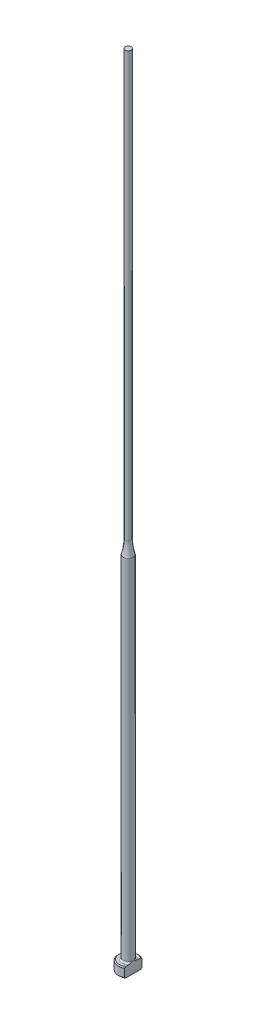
ISO-10303-21;
HEADER;
FILE_DESCRIPTION(('STEP AP214'),'2;1');
FILE_NAME('part.step','',(''),(''),'','','');
FILE_SCHEMA(('AUTOMOTIVE_DESIGN { 1 0 10303 214 1 1 1 1 }'));
ENDSEC;
DATA;
#1=APPLICATION_CONTEXT('core data for automotive mechanical design processes');
#2=APPLICATION_PROTOCOL_DEFINITION('international standard','automotive_design',2000,#1);
#3=PRODUCT_CONTEXT('',#1,'mechanical');
#4=PRODUCT('Part','Part','',(#3));
#5=PRODUCT_RELATED_PRODUCT_CATEGORY('part','',(#4));
#6=PRODUCT_DEFINITION_FORMATION('','',#4);
#7=PRODUCT_DEFINITION_CONTEXT('part definition',#1,'design');
#8=PRODUCT_DEFINITION('design','',#6,#7);
#9=PRODUCT_DEFINITION_SHAPE('','',#8);
#10=(LENGTH_UNIT() NAMED_UNIT(*) SI_UNIT(.MILLI.,.METRE.));
#11=(NAMED_UNIT(*) PLANE_ANGLE_UNIT() SI_UNIT($,.RADIAN.));
#12=(NAMED_UNIT(*) SI_UNIT($,.STERADIAN.) SOLID_ANGLE_UNIT());
#13=UNCERTAINTY_MEASURE_WITH_UNIT(LENGTH_MEASURE(1.E-05),#10,'distance_accuracy_value','');
#14=(GEOMETRIC_REPRESENTATION_CONTEXT(3) GLOBAL_UNCERTAINTY_ASSIGNED_CONTEXT((#13)) GLOBAL_UNIT_ASSIGNED_CONTEXT((#10,
#11,#12)) REPRESENTATION_CONTEXT('',''));
#15=CARTESIAN_POINT('',(0.,0.,0.));
#16=DIRECTION('',(0.,0.,1.));
#17=DIRECTION('',(1.,0.,0.));
#18=AXIS2_PLACEMENT_3D('',#15,#16,#17);
#19=CARTESIAN_POINT('',(-1.99999999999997,2.,0.));
#20=DIRECTION('',(0.,1.,0.));
#21=DIRECTION('',(0.,0.,1.));
#22=AXIS2_PLACEMENT_3D('',#19,#20,#21);
#23=PLANE('',#22);
#24=CARTESIAN_POINT('',(0.,2.,0.));
#25=DIRECTION('',(0.,1.,0.));
#26=DIRECTION('',(0.,0.,1.));
#27=AXIS2_PLACEMENT_3D('',#24,#25,#26);
#28=CIRCLE('',#27,1.79999999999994);
#29=CARTESIAN_POINT('',(0.999999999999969,2.,-1.49666295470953));
#30=VERTEX_POINT('',#29);
#31=CARTESIAN_POINT('',(0.999999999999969,2.,1.49666295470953));
#32=VERTEX_POINT('',#31);
#33=EDGE_CURVE('E187',#30,#32,#28,.T.);
#34=ORIENTED_EDGE('',*,*,#33,.T.);
#35=DIRECTION('',(0.,0.,-1.));
#36=VECTOR('',#35,1.);
#37=CARTESIAN_POINT('',(0.999999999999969,2.,0.));
#38=LINE('',#37,#36);
#39=CARTESIAN_POINT('',(0.999999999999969,2.00000000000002,0.830662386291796));
#40=VERTEX_POINT('',#39);
#41=EDGE_CURVE('E57',#32,#40,#38,.T.);
#42=ORIENTED_EDGE('',*,*,#41,.T.);
#43=CARTESIAN_POINT('',(0.,2.,0.));
#44=DIRECTION('',(0.,1.,0.));
#45=DIRECTION('',(0.,0.,1.));
#46=AXIS2_PLACEMENT_3D('',#43,#44,#45);
#47=CIRCLE('',#46,1.29999999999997);
#48=CARTESIAN_POINT('',(0.999999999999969,2.00000000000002,-0.830662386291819));
#49=VERTEX_POINT('',#48);
#50=EDGE_CURVE('E108',#40,#49,#47,.F.);
#51=ORIENTED_EDGE('',*,*,#50,.T.);
#52=EDGE_CURVE('E137',#49,#30,#38,.T.);
#53=ORIENTED_EDGE('',*,*,#52,.T.);
#54=EDGE_LOOP('',(#34,#42,#51,#53));
#55=FACE_BOUND('',#54,.T.);
#56=ADVANCED_FACE('F32',(#55),#23,.T.);
#57=CARTESIAN_POINT('',(0.,259.958771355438,0.));
#58=DIRECTION('',(0.,1.,0.));
#59=DIRECTION('',(0.,0.,1.));
#60=AXIS2_PLACEMENT_3D('',#57,#58,#59);
#61=CYLINDRICAL_SURFACE('',#60,1.99999999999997);
#62=CARTESIAN_POINT('',(0.,1.79999999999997,0.));
#63=DIRECTION('',(0.,1.,0.));
#64=DIRECTION('',(0.,0.,1.));
#65=AXIS2_PLACEMENT_3D('',#62,#63,#64);
#66=CIRCLE('',#65,1.99999999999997);
#67=CARTESIAN_POINT('',(0.999999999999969,1.79999999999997,1.73205080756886));
#68=VERTEX_POINT('',#67);
#69=CARTESIAN_POINT('',(0.999999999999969,1.79999999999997,-1.73205080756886));
#70=VERTEX_POINT('',#69);
#71=EDGE_CURVE('E105',#68,#70,#66,.F.);
#72=ORIENTED_EDGE('',*,*,#71,.T.);
#73=DIRECTION('',(0.,-1.,0.));
#74=VECTOR('',#73,1.);
#75=CARTESIAN_POINT('',(0.999999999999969,160.,-1.73205080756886));
#76=LINE('',#75,#74);
#77=CARTESIAN_POINT('',(0.999999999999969,0.199999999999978,-1.73205080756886));
#78=VERTEX_POINT('',#77);
#79=EDGE_CURVE('E193',#70,#78,#76,.T.);
#80=ORIENTED_EDGE('',*,*,#79,.T.);
#81=CARTESIAN_POINT('',(0.,0.199999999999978,0.));
#82=DIRECTION('',(0.,-1.,0.));
#83=DIRECTION('',(0.,0.,-1.));
#84=AXIS2_PLACEMENT_3D('',#81,#82,#83);
#85=CIRCLE('',#84,1.99999999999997);
#86=CARTESIAN_POINT('',(0.999999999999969,0.199999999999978,1.73205080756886));
#87=VERTEX_POINT('',#86);
#88=EDGE_CURVE('E100',#78,#87,#85,.F.);
#89=ORIENTED_EDGE('',*,*,#88,.T.);
#90=DIRECTION('',(0.,-1.,0.));
#91=VECTOR('',#90,1.);
#92=CARTESIAN_POINT('',(0.999999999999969,160.,1.73205080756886));
#93=LINE('',#92,#91);
#94=EDGE_CURVE('E93',#68,#87,#93,.T.);
#95=ORIENTED_EDGE('',*,*,#94,.F.);
#96=EDGE_LOOP('',(#72,#80,#89,#95));
#97=FACE_BOUND('',#96,.T.);
#98=ADVANCED_FACE('F158',(#97),#61,.T.);
#99=CARTESIAN_POINT('',(0.,0.,0.));
#100=DIRECTION('',(0.,-1.,0.));
#101=DIRECTION('',(0.,0.,-1.));
#102=AXIS2_PLACEMENT_3D('',#99,#100,#101);
#103=PLANE('',#102);
#104=CARTESIAN_POINT('',(0.,0.,0.));
#105=DIRECTION('',(0.,-1.,0.));
#106=DIRECTION('',(0.,0.,-1.));
#107=AXIS2_PLACEMENT_3D('',#104,#105,#106);
#108=CIRCLE('',#107,1.79999999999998);
#109=CARTESIAN_POINT('',(0.999999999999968,0.,1.49666295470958));
#110=VERTEX_POINT('',#109);
#111=CARTESIAN_POINT('',(0.999999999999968,0.,-1.49666295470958));
#112=VERTEX_POINT('',#111);
#113=EDGE_CURVE('E98',#110,#112,#108,.T.);
#114=ORIENTED_EDGE('',*,*,#113,.T.);
#115=DIRECTION('',(0.,0.,1.));
#116=VECTOR('',#115,1.);
#117=CARTESIAN_POINT('',(0.999999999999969,0.,-1.73205080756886));
#118=LINE('',#117,#116);
#119=EDGE_CURVE('E83',#112,#110,#118,.T.);
#120=ORIENTED_EDGE('',*,*,#119,.T.);
#121=EDGE_LOOP('',(#114,#120));
#122=FACE_BOUND('',#121,.T.);
#123=ADVANCED_FACE('F103',(#122),#103,.T.);
#124=CARTESIAN_POINT('',(0.,2.,0.));
#125=DIRECTION('',(0.,-1.,0.));
#126=DIRECTION('',(0.,0.,-1.));
#127=AXIS2_PLACEMENT_3D('',#124,#125,#126);
#128=CONICAL_SURFACE('',#127,1.79999999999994,0.785398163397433);
#129=ORIENTED_EDGE('',*,*,#71,.F.);
#130=CARTESIAN_POINT('',(0.999999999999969,-0.143084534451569,3.81417299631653));
#131=CARTESIAN_POINT('',(0.999999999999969,-0.0593997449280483,3.72765647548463));
#132=CARTESIAN_POINT('',(0.999999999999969,0.0241940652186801,3.64105173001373));
#133=CARTESIAN_POINT('',(0.999999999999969,0.191148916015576,3.46761616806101));
#134=CARTESIAN_POINT('',(0.999999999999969,0.274509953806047,3.3807853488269));
#135=CARTESIAN_POINT('',(0.999999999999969,0.524249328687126,3.11979400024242));
#136=CARTESIAN_POINT('',(0.999999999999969,0.690198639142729,2.94522254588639));
#137=CARTESIAN_POINT('',(0.999999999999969,1.01697550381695,2.59782670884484));
#138=CARTESIAN_POINT('',(0.999999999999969,1.17783928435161,2.42503661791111));
#139=CARTESIAN_POINT('',(0.999999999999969,1.41669118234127,2.16364984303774));
#140=CARTESIAN_POINT('',(0.999999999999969,1.49589273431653,2.07616357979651));
#141=CARTESIAN_POINT('',(0.999999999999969,1.65313803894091,1.90015721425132));
#142=CARTESIAN_POINT('',(0.999999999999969,1.73118183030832,1.81163714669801));
#143=CARTESIAN_POINT('',(0.999999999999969,1.85567318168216,1.66767927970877));
#144=CARTESIAN_POINT('',(0.999999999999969,1.90265415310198,1.61270332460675));
#145=CARTESIAN_POINT('',(0.999999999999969,1.99577882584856,1.50203557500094));
#146=CARTESIAN_POINT('',(0.999999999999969,2.04192244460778,1.44634371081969));
#147=CARTESIAN_POINT('',(0.999999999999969,2.13356596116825,1.33345480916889));
#148=CARTESIAN_POINT('',(0.999999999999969,2.17905399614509,1.2762481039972));
#149=CARTESIAN_POINT('',(0.999999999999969,2.26844283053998,1.16060976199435));
#150=CARTESIAN_POINT('',(0.999999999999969,2.3123437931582,1.10217825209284));
#151=CARTESIAN_POINT('',(0.999999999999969,2.39853453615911,0.982773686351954));
#152=CARTESIAN_POINT('',(0.999999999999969,2.44078986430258,0.921775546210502));
#153=CARTESIAN_POINT('',(0.999999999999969,2.52187810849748,0.797387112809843));
#154=CARTESIAN_POINT('',(0.999999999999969,2.56070631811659,0.733993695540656));
#155=CARTESIAN_POINT('',(0.999999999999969,2.6324859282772,0.604932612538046));
#156=CARTESIAN_POINT('',(0.999999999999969,2.66550424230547,0.539302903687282));
#157=CARTESIAN_POINT('',(0.999999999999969,2.72301550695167,0.404437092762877));
#158=CARTESIAN_POINT('',(0.999999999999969,2.74753707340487,0.335214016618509));
#159=CARTESIAN_POINT('',(0.999999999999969,2.77407110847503,0.231400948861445));
#160=CARTESIAN_POINT('',(0.999999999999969,2.78110742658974,0.198093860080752));
#161=CARTESIAN_POINT('',(0.999999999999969,2.79200506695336,0.130954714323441));
#162=CARTESIAN_POINT('',(0.999999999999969,2.7958666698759,0.0971227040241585));
#163=CARTESIAN_POINT('',(0.999999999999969,2.80013905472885,0.0293410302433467));
#164=CARTESIAN_POINT('',(0.999999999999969,2.80056046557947,-0.00460794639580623));
#165=CARTESIAN_POINT('',(0.999999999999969,2.79795882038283,-0.0723663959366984));
#166=CARTESIAN_POINT('',(0.999999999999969,2.79493547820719,-0.106175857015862));
#167=CARTESIAN_POINT('',(0.999999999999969,2.78105481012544,-0.206326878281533));
#168=CARTESIAN_POINT('',(0.999999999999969,2.76542146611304,-0.272037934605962));
#169=CARTESIAN_POINT('',(0.999999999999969,2.73477554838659,-0.368312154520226));
#170=CARTESIAN_POINT('',(0.999999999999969,2.72331063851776,-0.40012349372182));
#171=CARTESIAN_POINT('',(0.999999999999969,2.69840546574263,-0.46296441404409));
#172=CARTESIAN_POINT('',(0.999999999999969,2.68496560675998,-0.493994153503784));
#173=CARTESIAN_POINT('',(0.999999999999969,2.64209309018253,-0.586298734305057));
#174=CARTESIAN_POINT('',(0.999999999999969,2.61022871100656,-0.64643570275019));
#175=CARTESIAN_POINT('',(0.999999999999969,2.5422853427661,-0.764304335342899));
#176=CARTESIAN_POINT('',(0.999999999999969,2.50620119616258,-0.822032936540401));
#177=CARTESIAN_POINT('',(0.999999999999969,2.43107084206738,-0.935840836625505));
#178=CARTESIAN_POINT('',(0.999999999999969,2.39201347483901,-0.991912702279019));
#179=CARTESIAN_POINT('',(0.999999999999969,2.31195870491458,-1.10259849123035));
#180=CARTESIAN_POINT('',(0.999999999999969,2.27096226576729,-1.15721311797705));
#181=CARTESIAN_POINT('',(0.999999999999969,2.18701695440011,-1.26606869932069));
#182=CARTESIAN_POINT('',(0.999999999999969,2.14404946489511,-1.32029522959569));
#183=CARTESIAN_POINT('',(0.999999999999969,2.0570505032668,-1.4278898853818));
#184=CARTESIAN_POINT('',(0.999999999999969,2.01301896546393,-1.48125795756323));
#185=CARTESIAN_POINT('',(0.999999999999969,1.87995068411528,-1.64010952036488));
#186=CARTESIAN_POINT('',(0.999999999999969,1.78973357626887,-1.74460261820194));
#187=CARTESIAN_POINT('',(0.999999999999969,1.62290341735,-1.93426834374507));
#188=CARTESIAN_POINT('',(0.999999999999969,1.54658658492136,-2.01970404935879));
#189=CARTESIAN_POINT('',(0.999999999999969,1.39301250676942,-2.18973019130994));
#190=CARTESIAN_POINT('',(0.999999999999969,1.31575523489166,-2.27432060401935));
#191=CARTESIAN_POINT('',(0.999999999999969,1.08283440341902,-2.52732479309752));
#192=CARTESIAN_POINT('',(0.999999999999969,0.926165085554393,-2.69481086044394));
#193=CARTESIAN_POINT('',(0.999999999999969,0.617772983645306,-3.02147252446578));
#194=CARTESIAN_POINT('',(0.999999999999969,0.466111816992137,-3.18070657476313));
#195=CARTESIAN_POINT('',(0.999999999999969,0.238015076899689,-3.41880818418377));
#196=CARTESIAN_POINT('',(0.999999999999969,0.1619245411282,-3.49800657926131));
#197=CARTESIAN_POINT('',(0.999999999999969,0.00955322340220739,-3.65621892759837));
#198=CARTESIAN_POINT('',(0.999999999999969,-0.0667275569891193,-3.73523288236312));
#199=CARTESIAN_POINT('',(0.999999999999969,-0.14308453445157,-3.81417299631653));
#200=B_SPLINE_CURVE_WITH_KNOTS('',3,(#130,#131,#132,#133,#134,#135,#136,#137,#138,#139,#140,
#141,#142,#143,#144,#145,#146,#147,#148,#149,#150,#151,#152,#153,#154,#155,#156,#157,#158,#159,
#160,#161,#162,#163,#164,#165,#166,#167,#168,#169,#170,#171,#172,#173,#174,#175,#176,#177,#178,
#179,#180,#181,#182,#183,#184,#185,#186,#187,#188,#189,#190,#191,#192,#193,#194,#195,#196,#197,
#198,#199),.UNSPECIFIED.,.F.,.F.,(4,2,2,2,2,2,2,2,2,2,2,2,2,2,2,2,2,2,2,2,2,2,2,2,2,2,2,2,2,2,2,
2,2,2,4),(0.,0.36110162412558,0.722207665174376,1.44478731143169,2.15299784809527,
2.5070263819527,2.8610430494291,3.07798416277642,3.29494655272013,3.51418925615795,
3.73340935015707,3.95594813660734,4.17878792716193,4.39886399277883,4.61819150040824,
4.72018864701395,4.82217677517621,4.92384967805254,5.02553102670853,5.22698459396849,
5.32838854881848,5.4297717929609,5.63365200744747,5.837784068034,6.04272417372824,
6.24756349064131,6.45510395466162,6.66265726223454,7.07676259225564,7.42043039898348,
7.76410778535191,8.45210822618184,9.11180822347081,9.44129145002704,9.77077197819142),.UNSPECIFIED.);
#201=EDGE_CURVE('E136',#68,#32,#200,.T.);
#202=ORIENTED_EDGE('',*,*,#201,.T.);
#203=ORIENTED_EDGE('',*,*,#33,.F.);
#204=EDGE_CURVE('E128',#30,#70,#200,.T.);
#205=ORIENTED_EDGE('',*,*,#204,.T.);
#206=EDGE_LOOP('',(#129,#202,#203,#205));
#207=FACE_BOUND('',#206,.T.);
#208=ADVANCED_FACE('F144',(#207),#128,.T.);
#209=CARTESIAN_POINT('',(0.,0.199999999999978,0.));
#210=DIRECTION('',(0.,1.,0.));
#211=DIRECTION('',(0.,0.,1.));
#212=AXIS2_PLACEMENT_3D('',#209,#210,#211);
#213=CONICAL_SURFACE('',#212,1.99999999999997,0.785398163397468);
#214=ORIENTED_EDGE('',*,*,#88,.F.);
#215=CARTESIAN_POINT('',(0.999999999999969,2.14308453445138,-3.81417299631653));
#216=CARTESIAN_POINT('',(0.999999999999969,2.05939974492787,-3.72765647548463));
#217=CARTESIAN_POINT('',(0.999999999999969,1.97580593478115,-3.64105173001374));
#218=CARTESIAN_POINT('',(0.999999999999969,1.80885108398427,-3.46761616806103));
#219=CARTESIAN_POINT('',(0.999999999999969,1.72549004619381,-3.38078534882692));
#220=CARTESIAN_POINT('',(0.999999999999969,1.47575067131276,-3.11979400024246));
#221=CARTESIAN_POINT('',(0.999999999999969,1.30980136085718,-2.94522254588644));
#222=CARTESIAN_POINT('',(0.999999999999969,0.983024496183,-2.5978267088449));
#223=CARTESIAN_POINT('',(0.999999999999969,0.822160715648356,-2.42503661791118));
#224=CARTESIAN_POINT('',(0.999999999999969,0.583308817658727,-2.16364984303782));
#225=CARTESIAN_POINT('',(0.999999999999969,0.50410726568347,-2.0761635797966));
#226=CARTESIAN_POINT('',(0.999999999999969,0.346861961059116,-1.90015721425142));
#227=CARTESIAN_POINT('',(0.999999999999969,0.26881816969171,-1.81163714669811));
#228=CARTESIAN_POINT('',(0.999999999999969,0.144326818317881,-1.66767927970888));
#229=CARTESIAN_POINT('',(0.999999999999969,0.0973458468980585,-1.61270332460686));
#230=CARTESIAN_POINT('',(0.999999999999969,0.00422117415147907,-1.50203557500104));
#231=CARTESIAN_POINT('',(0.999999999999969,-0.0419224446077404,-1.44634371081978));
#232=CARTESIAN_POINT('',(0.999999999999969,-0.133565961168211,-1.33345480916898));
#233=CARTESIAN_POINT('',(0.999999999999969,-0.179053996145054,-1.27624810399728));
#234=CARTESIAN_POINT('',(0.999999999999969,-0.268442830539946,-1.16060976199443));
#235=CARTESIAN_POINT('',(0.999999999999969,-0.31234379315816,-1.10217825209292));
#236=CARTESIAN_POINT('',(0.999999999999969,-0.398534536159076,-0.982773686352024));
#237=CARTESIAN_POINT('',(0.999999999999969,-0.440789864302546,-0.92177554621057));
#238=CARTESIAN_POINT('',(0.999999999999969,-0.521878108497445,-0.797387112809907));
#239=CARTESIAN_POINT('',(0.999999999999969,-0.560706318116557,-0.733993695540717));
#240=CARTESIAN_POINT('',(0.999999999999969,-0.632485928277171,-0.604932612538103));
#241=CARTESIAN_POINT('',(0.999999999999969,-0.665504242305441,-0.539302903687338));
#242=CARTESIAN_POINT('',(0.999999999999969,-0.723015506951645,-0.404437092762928));
#243=CARTESIAN_POINT('',(0.999999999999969,-0.747537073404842,-0.335214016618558));
#244=CARTESIAN_POINT('',(0.999999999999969,-0.774071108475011,-0.231400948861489));
#245=CARTESIAN_POINT('',(0.999999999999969,-0.781107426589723,-0.198093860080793));
#246=CARTESIAN_POINT('',(0.999999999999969,-0.792005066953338,-0.130954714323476));
#247=CARTESIAN_POINT('',(0.999999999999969,-0.795866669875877,-0.0971227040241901));
#248=CARTESIAN_POINT('',(0.999999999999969,-0.800139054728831,-0.0293410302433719));
#249=CARTESIAN_POINT('',(0.999999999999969,-0.80056046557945,0.00460794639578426));
#250=CARTESIAN_POINT('',(0.999999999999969,-0.797958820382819,0.0723663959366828));
#251=CARTESIAN_POINT('',(0.999999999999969,-0.794935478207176,0.106175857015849));
#252=CARTESIAN_POINT('',(0.999999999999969,-0.781054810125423,0.20632687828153));
#253=CARTESIAN_POINT('',(0.999999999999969,-0.765421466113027,0.272037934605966));
#254=CARTESIAN_POINT('',(0.999999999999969,-0.734775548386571,0.36831215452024));
#255=CARTESIAN_POINT('',(0.999999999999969,-0.723310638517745,0.400123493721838));
#256=CARTESIAN_POINT('',(0.999999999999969,-0.698405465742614,0.462964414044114));
#257=CARTESIAN_POINT('',(0.999999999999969,-0.684965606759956,0.493994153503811));
#258=CARTESIAN_POINT('',(0.999999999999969,-0.642093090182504,0.586298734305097));
#259=CARTESIAN_POINT('',(0.999999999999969,-0.610228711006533,0.646435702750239));
#260=CARTESIAN_POINT('',(0.999999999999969,-0.542285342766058,0.764304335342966));
#261=CARTESIAN_POINT('',(0.999999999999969,-0.506201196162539,0.822032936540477));
#262=CARTESIAN_POINT('',(0.999999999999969,-0.431070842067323,0.935840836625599));
#263=CARTESIAN_POINT('',(0.999999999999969,-0.392013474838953,0.991912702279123));
#264=CARTESIAN_POINT('',(0.999999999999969,-0.311958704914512,1.10259849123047));
#265=CARTESIAN_POINT('',(0.999999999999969,-0.270962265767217,1.15721311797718));
#266=CARTESIAN_POINT('',(0.999999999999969,-0.187016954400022,1.26606869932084));
#267=CARTESIAN_POINT('',(0.999999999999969,-0.144049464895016,1.32029522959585));
#268=CARTESIAN_POINT('',(0.999999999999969,-0.0570505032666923,1.42788988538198));
#269=CARTESIAN_POINT('',(0.999999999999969,-0.0130189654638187,1.48125795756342));
#270=CARTESIAN_POINT('',(0.999999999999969,0.120049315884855,1.64010952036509));
#271=CARTESIAN_POINT('',(0.999999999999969,0.21026642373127,1.74460261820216));
#272=CARTESIAN_POINT('',(0.999999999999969,0.37709658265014,1.9342683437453));
#273=CARTESIAN_POINT('',(0.999999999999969,0.453413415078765,2.01970404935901));
#274=CARTESIAN_POINT('',(0.999999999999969,0.606987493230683,2.18973019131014));
#275=CARTESIAN_POINT('',(0.999999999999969,0.684244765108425,2.27432060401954));
#276=CARTESIAN_POINT('',(0.999999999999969,0.917165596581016,2.52732479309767));
#277=CARTESIAN_POINT('',(0.999999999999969,1.07383491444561,2.69481086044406));
#278=CARTESIAN_POINT('',(0.999999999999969,1.38222701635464,3.02147252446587));
#279=CARTESIAN_POINT('',(0.999999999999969,1.53388818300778,3.1807065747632));
#280=CARTESIAN_POINT('',(0.999999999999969,1.76198492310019,3.41880818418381));
#281=CARTESIAN_POINT('',(0.999999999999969,1.83807545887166,3.49800657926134));
#282=CARTESIAN_POINT('',(0.999999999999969,1.99044677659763,3.65621892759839));
#283=CARTESIAN_POINT('',(0.999999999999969,2.06672755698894,3.73523288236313));
#284=CARTESIAN_POINT('',(0.999999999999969,2.14308453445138,3.81417299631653));
#285=B_SPLINE_CURVE_WITH_KNOTS('',3,(#215,#216,#217,#218,#219,#220,#221,#222,#223,#224,#225,
#226,#227,#228,#229,#230,#231,#232,#233,#234,#235,#236,#237,#238,#239,#240,#241,#242,#243,#244,
#245,#246,#247,#248,#249,#250,#251,#252,#253,#254,#255,#256,#257,#258,#259,#260,#261,#262,#263,
#264,#265,#266,#267,#268,#269,#270,#271,#272,#273,#274,#275,#276,#277,#278,#279,#280,#281,#282,
#283,#284),.UNSPECIFIED.,.F.,.F.,(4,2,2,2,2,2,2,2,2,2,2,2,2,2,2,2,2,2,2,2,2,2,2,2,2,2,2,2,2,2,2,
2,2,2,4),(0.,0.36110162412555,0.722207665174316,1.44478731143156,2.15299784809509,
2.5070263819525,2.86104304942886,3.07798416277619,3.2949465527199,3.51418925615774,
3.73340935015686,3.95594813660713,4.17878792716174,4.39886399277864,4.61819150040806,
4.72018864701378,4.82217677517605,4.92384967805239,5.02553102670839,5.22698459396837,
5.32838854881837,5.4297717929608,5.6336520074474,5.83778406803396,6.04272417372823,
6.24756349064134,6.45510395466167,6.66265726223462,7.07676259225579,7.42043039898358,
7.76410778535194,8.45210822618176,9.11180822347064,9.44129145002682,9.77077197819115),.UNSPECIFIED.);
#286=EDGE_CURVE('E86',#78,#112,#285,.T.);
#287=ORIENTED_EDGE('',*,*,#286,.T.);
#288=ORIENTED_EDGE('',*,*,#113,.F.);
#289=EDGE_CURVE('E89',#110,#87,#285,.T.);
#290=ORIENTED_EDGE('',*,*,#289,.T.);
#291=EDGE_LOOP('',(#214,#287,#288,#290));
#292=FACE_BOUND('',#291,.T.);
#293=ADVANCED_FACE('F97',(#292),#213,.T.);
#294=CARTESIAN_POINT('',(0.,2.30000000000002,0.));
#295=DIRECTION('',(0.,1.,0.));
#296=DIRECTION('',(0.,0.,1.));
#297=AXIS2_PLACEMENT_3D('',#294,#295,#296);
#298=TOROIDAL_SURFACE('',#297,1.29999999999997,0.3);
#299=CARTESIAN_POINT('',(0.999999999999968,2.30000000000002,0.));
#300=CARTESIAN_POINT('',(0.999999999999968,2.30000064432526,8.6574445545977E-12));
#301=CARTESIAN_POINT('',(0.999999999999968,2.30000128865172,-9.05742231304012E-08));
#302=CARTESIAN_POINT('',(0.999999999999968,2.30000254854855,-3.98319620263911E-07));
#303=CARTESIAN_POINT('',(0.999999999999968,2.30000316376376,-6.16748313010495E-07));
#304=CARTESIAN_POINT('',(0.999999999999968,2.30000438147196,-1.15047367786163E-06));
#305=CARTESIAN_POINT('',(0.999999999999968,2.30000498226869,-1.46954564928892E-06));
#306=CARTESIAN_POINT('',(0.999999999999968,2.30000613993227,-2.17388585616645E-06));
#307=CARTESIAN_POINT('',(0.999999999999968,2.3000066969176,-2.55896592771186E-06));
#308=CARTESIAN_POINT('',(0.999999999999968,2.30000847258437,-3.89137454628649E-06));
#309=CARTESIAN_POINT('',(0.999999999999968,2.30000962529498,-4.9272569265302E-06));
#310=CARTESIAN_POINT('',(0.999999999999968,2.30001175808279,-7.12255376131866E-06));
#311=CARTESIAN_POINT('',(0.999999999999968,2.30001274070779,-8.27963246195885E-06));
#312=CARTESIAN_POINT('',(0.999999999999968,2.30001619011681,-1.25710396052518E-05));
#313=CARTESIAN_POINT('',(0.999999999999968,2.30001847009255,-1.58589994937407E-05));
#314=CARTESIAN_POINT('',(0.999999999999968,2.3000224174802,-2.25210462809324E-05));
#315=CARTESIAN_POINT('',(0.999999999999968,2.30002411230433,-2.58796667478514E-05));
#316=CARTESIAN_POINT('',(0.999999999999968,2.30003085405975,-3.94941957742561E-05));
#317=CARTESIAN_POINT('',(0.999999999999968,2.30003568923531,-4.98493079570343E-05));
#318=CARTESIAN_POINT('',(0.999999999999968,2.30004388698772,-6.96407730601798E-05));
#319=CARTESIAN_POINT('',(0.999999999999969,2.30004735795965,-7.903098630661E-05));
#320=CARTESIAN_POINT('',(0.999999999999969,2.30007348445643,-0.000144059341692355));
#321=CARTESIAN_POINT('',(0.999999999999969,2.30010510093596,-0.000195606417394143));
#322=CARTESIAN_POINT('',(0.999999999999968,2.30022061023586,-0.000391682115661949));
#323=CARTESIAN_POINT('',(0.999999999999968,2.3002978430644,-0.000539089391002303));
#324=CARTESIAN_POINT('',(0.999999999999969,2.30059433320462,-0.00109591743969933));
#325=CARTESIAN_POINT('',(0.999999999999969,2.30082052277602,-0.00150237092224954));
#326=CARTESIAN_POINT('',(0.999999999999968,2.30171558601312,-0.00311941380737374));
#327=CARTESIAN_POINT('',(0.999999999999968,2.30237677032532,-0.00433326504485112));
#328=CARTESIAN_POINT('',(0.999999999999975,2.31602135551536,-0.0293725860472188));
#329=CARTESIAN_POINT('',(0.99999999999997,2.32909104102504,-0.0531623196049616));
#330=CARTESIAN_POINT('',(0.999999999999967,2.35458080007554,-0.100088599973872));
#331=CARTESIAN_POINT('',(0.999999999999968,2.36700820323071,-0.123221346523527));
#332=CARTESIAN_POINT('',(0.999999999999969,2.39281545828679,-0.172044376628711));
#333=CARTESIAN_POINT('',(0.999999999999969,2.4061616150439,-0.197752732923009));
#334=CARTESIAN_POINT('',(0.999999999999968,2.4323541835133,-0.249714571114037));
#335=CARTESIAN_POINT('',(0.999999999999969,2.44519503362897,-0.27597087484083));
#336=CARTESIAN_POINT('',(0.999999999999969,2.46718175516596,-0.322864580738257));
#337=CARTESIAN_POINT('',(0.999999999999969,2.47650292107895,-0.34341923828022));
#338=CARTESIAN_POINT('',(0.999999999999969,2.49448113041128,-0.384761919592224));
#339=CARTESIAN_POINT('',(0.999999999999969,2.50313958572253,-0.405549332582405));
#340=CARTESIAN_POINT('',(0.999999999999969,2.5276434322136,-0.467585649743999));
#341=CARTESIAN_POINT('',(0.999999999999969,2.54239224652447,-0.509286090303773));
#342=CARTESIAN_POINT('',(0.999999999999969,2.56458900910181,-0.58349816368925));
#343=CARTESIAN_POINT('',(0.999999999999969,2.57294045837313,-0.61573699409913));
#344=CARTESIAN_POINT('',(0.999999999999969,2.58691787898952,-0.682155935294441));
#345=CARTESIAN_POINT('',(0.999999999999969,2.5924232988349,-0.716362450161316));
#346=CARTESIAN_POINT('',(0.999999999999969,2.59932200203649,-0.784996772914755));
#347=CARTESIAN_POINT('',(0.999999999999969,2.60074119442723,-0.819421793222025));
#348=CARTESIAN_POINT('',(0.999999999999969,2.59853032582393,-0.88779225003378));
#349=CARTESIAN_POINT('',(0.999999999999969,2.59495737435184,-0.921738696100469));
#350=CARTESIAN_POINT('',(0.999999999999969,2.58381038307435,-0.977927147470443));
#351=CARTESIAN_POINT('',(0.999999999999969,2.57785171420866,-1.00048693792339));
#352=CARTESIAN_POINT('',(0.999999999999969,2.56267132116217,-1.0445512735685));
#353=CARTESIAN_POINT('',(0.999999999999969,2.55344592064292,-1.06605459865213));
#354=CARTESIAN_POINT('',(0.999999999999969,2.53348156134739,-1.10327564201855));
#355=CARTESIAN_POINT('',(0.999999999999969,2.52335553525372,-1.11931996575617));
#356=CARTESIAN_POINT('',(0.999999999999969,2.50063930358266,-1.1495565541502));
#357=CARTESIAN_POINT('',(0.999999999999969,2.48805327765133,-1.16375189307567));
#358=CARTESIAN_POINT('',(0.999999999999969,2.46313284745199,-1.18709127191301));
#359=CARTESIAN_POINT('',(0.999999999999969,2.45121755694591,-1.19668155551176));
#360=CARTESIAN_POINT('',(0.999999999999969,2.4259612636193,-1.21377371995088));
#361=CARTESIAN_POINT('',(0.999999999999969,2.41262072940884,-1.2212762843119));
#362=CARTESIAN_POINT('',(0.999999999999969,2.38471163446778,-1.23381879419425));
#363=CARTESIAN_POINT('',(0.999999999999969,2.3701356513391,-1.23884240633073));
#364=CARTESIAN_POINT('',(0.999999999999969,2.34029120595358,-1.2460136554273));
#365=CARTESIAN_POINT('',(0.999999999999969,2.32502317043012,-1.24816304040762));
#366=CARTESIAN_POINT('',(0.999999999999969,2.29609418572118,-1.24936303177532));
#367=CARTESIAN_POINT('',(0.999999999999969,2.28244572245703,-1.24873511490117));
#368=CARTESIAN_POINT('',(0.999999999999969,2.25546467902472,-1.24513625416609));
#369=CARTESIAN_POINT('',(0.999999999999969,2.2421320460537,-1.24216570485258));
#370=CARTESIAN_POINT('',(0.999999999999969,2.21644742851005,-1.23414136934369));
#371=CARTESIAN_POINT('',(0.999999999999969,2.20408009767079,-1.22913614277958));
#372=CARTESIAN_POINT('',(0.999999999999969,2.18026539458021,-1.2172891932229));
#373=CARTESIAN_POINT('',(0.999999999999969,2.16881815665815,-1.21044720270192));
#374=CARTESIAN_POINT('',(0.999999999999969,2.14602713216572,-1.19450929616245));
#375=CARTESIAN_POINT('',(0.999999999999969,2.1347876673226,-1.18526487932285));
#376=CARTESIAN_POINT('',(0.999999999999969,2.11372805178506,-1.16528066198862));
#377=CARTESIAN_POINT('',(0.999999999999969,2.1039092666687,-1.15453944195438));
#378=CARTESIAN_POINT('',(0.999999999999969,2.08131380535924,-1.12639326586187));
#379=CARTESIAN_POINT('',(0.999999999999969,2.06941227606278,-1.10828305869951));
#380=CARTESIAN_POINT('',(0.999999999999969,2.04871157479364,-1.07041295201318));
#381=CARTESIAN_POINT('',(0.999999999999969,2.03991325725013,-1.05065259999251));
#382=CARTESIAN_POINT('',(0.999999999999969,2.02219264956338,-1.00203188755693));
#383=CARTESIAN_POINT('',(0.999999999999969,2.01461756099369,-0.972682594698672));
#384=CARTESIAN_POINT('',(0.999999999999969,2.00410660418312,-0.912914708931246));
#385=CARTESIAN_POINT('',(0.999999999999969,2.00122174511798,-0.882487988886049));
#386=CARTESIAN_POINT('',(0.999999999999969,1.99886242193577,-0.80318909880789));
#387=CARTESIAN_POINT('',(0.999999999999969,2.0024814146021,-0.754226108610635));
#388=CARTESIAN_POINT('',(0.999999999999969,2.01327071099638,-0.682724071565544));
#389=CARTESIAN_POINT('',(0.999999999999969,2.01762186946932,-0.659663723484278));
#390=CARTESIAN_POINT('',(0.999999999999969,2.02775671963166,-0.613959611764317));
#391=CARTESIAN_POINT('',(0.999999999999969,2.03353398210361,-0.59131445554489));
#392=CARTESIAN_POINT('',(0.999999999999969,2.05232003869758,-0.525222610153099));
#393=CARTESIAN_POINT('',(0.999999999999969,2.0670175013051,-0.482256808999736));
#394=CARTESIAN_POINT('',(0.999999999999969,2.09166172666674,-0.418361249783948));
#395=CARTESIAN_POINT('',(0.999999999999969,2.10040936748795,-0.396945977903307));
#396=CARTESIAN_POINT('',(0.999999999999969,2.11862724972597,-0.354367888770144));
#397=CARTESIAN_POINT('',(0.999999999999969,2.12809902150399,-0.33320572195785));
#398=CARTESIAN_POINT('',(0.999999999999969,2.15054796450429,-0.284809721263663));
#399=CARTESIAN_POINT('',(0.999999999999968,2.16372144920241,-0.257667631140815));
#400=CARTESIAN_POINT('',(0.999999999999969,2.19063957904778,-0.203972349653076));
#401=CARTESIAN_POINT('',(0.999999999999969,2.20437810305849,-0.177416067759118));
#402=CARTESIAN_POINT('',(0.999999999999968,2.23096755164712,-0.127000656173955));
#403=CARTESIAN_POINT('',(0.999999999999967,2.2437812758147,-0.103121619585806));
#404=CARTESIAN_POINT('',(0.99999999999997,2.27007504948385,-0.0546869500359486));
#405=CARTESIAN_POINT('',(0.999999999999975,2.28356304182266,-0.0301354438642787));
#406=CARTESIAN_POINT('',(0.999999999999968,2.29762327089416,-0.00433318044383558));
#407=CARTESIAN_POINT('',(0.999999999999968,2.29828450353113,-0.00311924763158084));
#408=CARTESIAN_POINT('',(0.999999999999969,2.29917957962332,-0.0015021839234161));
#409=CARTESIAN_POINT('',(0.999999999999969,2.2994057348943,-0.0010957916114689));
#410=CARTESIAN_POINT('',(0.999999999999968,2.29970218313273,-0.000539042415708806));
#411=CARTESIAN_POINT('',(0.999999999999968,2.29977940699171,-0.000391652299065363));
#412=CARTESIAN_POINT('',(0.999999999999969,2.29989490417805,-0.000195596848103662));
#413=CARTESIAN_POINT('',(0.999999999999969,2.2999265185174,-0.000144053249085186));
#414=CARTESIAN_POINT('',(0.999999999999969,2.29995264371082,-7.90290824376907E-05));
#415=CARTESIAN_POINT('',(0.999999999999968,2.29995611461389,-6.96391975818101E-05));
#416=CARTESIAN_POINT('',(0.999999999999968,2.29996431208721,-4.98484228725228E-05));
#417=CARTESIAN_POINT('',(0.999999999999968,2.29996914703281,-3.94936645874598E-05));
#418=CARTESIAN_POINT('',(0.999999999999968,2.29997588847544,-2.587953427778E-05));
#419=CARTESIAN_POINT('',(0.999999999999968,2.29997758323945,-2.25209724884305E-05));
#420=CARTESIAN_POINT('',(0.999999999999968,2.29998153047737,-1.58590310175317E-05));
#421=CARTESIAN_POINT('',(0.999999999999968,2.29998381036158,-1.25711163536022E-05));
#422=CARTESIAN_POINT('',(0.999999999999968,2.29998725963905,-8.27974911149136E-06));
#423=CARTESIAN_POINT('',(0.999999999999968,2.29998824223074,-7.122675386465E-06));
#424=CARTESIAN_POINT('',(0.999999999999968,2.29999037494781,-4.92738159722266E-06));
#425=CARTESIAN_POINT('',(0.999999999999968,2.29999152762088,-3.89149712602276E-06));
#426=CARTESIAN_POINT('',(0.999999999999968,2.29999330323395,-2.5590774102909E-06));
#427=CARTESIAN_POINT('',(0.999999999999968,2.29999386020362,-2.17399250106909E-06));
#428=CARTESIAN_POINT('',(0.999999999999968,2.29999501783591,-1.4696398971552E-06));
#429=CARTESIAN_POINT('',(0.999999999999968,2.299995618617,-1.15056035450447E-06));
#430=CARTESIAN_POINT('',(0.999999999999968,2.29999683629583,-6.16816558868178E-07));
#431=CARTESIAN_POINT('',(0.999999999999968,2.29999745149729,-3.98377208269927E-07));
#432=CARTESIAN_POINT('',(0.999999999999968,2.29999871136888,-9.06063088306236E-08));
#433=CARTESIAN_POINT('',(0.999999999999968,2.29999935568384,-8.657323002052E-12));
#434=CARTESIAN_POINT('',(0.999999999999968,2.30000000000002,0.));
#435=B_SPLINE_CURVE_WITH_KNOTS('',3,(#299,#300,#301,#302,#303,#304,#305,#306,#307,#308,#309,
#310,#311,#312,#313,#314,#315,#316,#317,#318,#319,#320,#321,#322,#323,#324,#325,#326,#327,#328,
#329,#330,#331,#332,#333,#334,#335,#336,#337,#338,#339,#340,#341,#342,#343,#344,#345,#346,#347,
#348,#349,#350,#351,#352,#353,#354,#355,#356,#357,#358,#359,#360,#361,#362,#363,#364,#365,#366,
#367,#368,#369,#370,#371,#372,#373,#374,#375,#376,#377,#378,#379,#380,#381,#382,#383,#384,#385,
#386,#387,#388,#389,#390,#391,#392,#393,#394,#395,#396,#397,#398,#399,#400,#401,#402,#403,#404,
#405,#406,#407,#408,#409,#410,#411,#412,#413,#414,#415,#416,#417,#418,#419,#420,#421,#422,#423,
#424,#425,#426,#427,#428,#429,#430,#431,#432,#433,#434),.UNSPECIFIED.,.T.,.F.,(4,2,2,2,2,2,2,2,
2,2,2,2,2,2,2,2,2,2,2,2,2,2,2,2,2,2,2,2,2,2,2,2,2,2,2,2,2,2,2,2,2,2,2,2,2,2,2,2,2,2,2,2,2,2,2,2,
2,2,2,2,2,2,2,2,2,2,2,4),(0.,1.93088000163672E-06,3.88121487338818E-06,5.91576027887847E-06,
7.94459959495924E-06,1.25713540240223E-05,1.71213138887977E-05,2.9075120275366E-05,
4.0350817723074E-05,7.46190414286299E-05,0.000104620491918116,0.00028499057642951,
0.000785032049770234,0.00217951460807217,0.00632720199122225,0.0877445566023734,
0.166524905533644,0.253417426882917,0.341089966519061,0.408787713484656,0.476336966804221,
0.608850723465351,0.708652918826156,0.812393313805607,0.915474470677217,1.01738599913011,
1.08718721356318,1.15706723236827,1.21377727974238,1.27039179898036,1.31609373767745,
1.36178069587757,1.40776478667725,1.4537208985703,1.49450576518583,1.5352837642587,
1.57514089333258,1.61500383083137,1.65849635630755,1.70203041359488,1.76667915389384,
1.83134568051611,1.92177629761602,2.0131839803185,2.15955153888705,2.22993031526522,
2.29999742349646,2.43600819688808,2.50540041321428,2.57494356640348,2.66544006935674,
2.75513178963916,2.83643278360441,2.92045687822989,2.92460484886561,2.92599912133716,
2.926499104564,2.92667946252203,2.92670946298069,2.92674372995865,2.92675500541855,
2.92676695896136,2.92677150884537,2.92677613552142,2.92677816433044,2.92678019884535,
2.92678214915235,2.92678408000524),.UNSPECIFIED.);
#436=CARTESIAN_POINT('',(0.999999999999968,2.30000000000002,0.));
#437=VERTEX_POINT('',#436);
#438=EDGE_CURVE('E11',#49,#437,#435,.T.);
#439=ORIENTED_EDGE('',*,*,#438,.F.);
#440=ORIENTED_EDGE('',*,*,#50,.F.);
#441=CARTESIAN_POINT('',(0.999999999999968,2.30000000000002,0.));
#442=CARTESIAN_POINT('',(0.999999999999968,2.29999935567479,-8.65741696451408E-12));
#443=CARTESIAN_POINT('',(0.999999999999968,2.29999871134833,9.05742231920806E-08));
#444=CARTESIAN_POINT('',(0.999999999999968,2.2999974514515,3.98319620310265E-07));
#445=CARTESIAN_POINT('',(0.999999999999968,2.29999683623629,6.16748313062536E-07));
#446=CARTESIAN_POINT('',(0.999999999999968,2.29999561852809,1.15047367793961E-06));
#447=CARTESIAN_POINT('',(0.999999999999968,2.29999501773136,1.46954564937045E-06));
#448=CARTESIAN_POINT('',(0.999999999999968,2.29999386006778,2.17388585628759E-06));
#449=CARTESIAN_POINT('',(0.999999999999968,2.29999330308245,2.55896592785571E-06));
#450=CARTESIAN_POINT('',(0.999999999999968,2.29999152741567,3.89137454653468E-06));
#451=CARTESIAN_POINT('',(0.999999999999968,2.29999037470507,4.92725692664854E-06));
#452=CARTESIAN_POINT('',(0.999999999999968,2.29998824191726,7.12255376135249E-06));
#453=CARTESIAN_POINT('',(0.999999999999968,2.29998725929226,8.27963246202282E-06));
#454=CARTESIAN_POINT('',(0.999999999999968,2.29998380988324,1.25710396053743E-05));
#455=CARTESIAN_POINT('',(0.999999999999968,2.2999815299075,1.58589994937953E-05));
#456=CARTESIAN_POINT('',(0.999999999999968,2.29997758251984,2.25210462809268E-05));
#457=CARTESIAN_POINT('',(0.999999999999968,2.29997588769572,2.58796667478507E-05));
#458=CARTESIAN_POINT('',(0.999999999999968,2.29996914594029,3.94941957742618E-05));
#459=CARTESIAN_POINT('',(0.999999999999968,2.29996431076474,4.98493079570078E-05));
#460=CARTESIAN_POINT('',(0.999999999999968,2.29995611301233,6.96407730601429E-05));
#461=CARTESIAN_POINT('',(0.999999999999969,2.2999526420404,7.90309863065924E-05));
#462=CARTESIAN_POINT('',(0.999999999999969,2.29992651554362,0.000144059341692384));
#463=CARTESIAN_POINT('',(0.999999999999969,2.29989489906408,0.000195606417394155));
#464=CARTESIAN_POINT('',(0.999999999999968,2.29977938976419,0.000391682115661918));
#465=CARTESIAN_POINT('',(0.999999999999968,2.29970215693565,0.000539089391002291));
#466=CARTESIAN_POINT('',(0.999999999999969,2.29940566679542,0.00109591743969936));
#467=CARTESIAN_POINT('',(0.999999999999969,2.29917947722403,0.00150237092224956));
#468=CARTESIAN_POINT('',(0.999999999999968,2.29828441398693,0.0031194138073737));
#469=CARTESIAN_POINT('',(0.999999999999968,2.29762322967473,0.0043332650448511));
#470=CARTESIAN_POINT('',(0.999999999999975,2.28397864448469,0.0293725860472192));
#471=CARTESIAN_POINT('',(0.99999999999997,2.27090895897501,0.0531623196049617));
#472=CARTESIAN_POINT('',(0.999999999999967,2.24541919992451,0.100088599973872));
#473=CARTESIAN_POINT('',(0.999999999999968,2.23299179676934,0.123221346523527));
#474=CARTESIAN_POINT('',(0.999999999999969,2.20718454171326,0.172044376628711));
#475=CARTESIAN_POINT('',(0.999999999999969,2.19383838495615,0.197752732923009));
#476=CARTESIAN_POINT('',(0.999999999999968,2.16764581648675,0.249714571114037));
#477=CARTESIAN_POINT('',(0.999999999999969,2.15480496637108,0.27597087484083));
#478=CARTESIAN_POINT('',(0.999999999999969,2.13281824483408,0.322864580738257));
#479=CARTESIAN_POINT('',(0.999999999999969,2.1234970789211,0.34341923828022));
#480=CARTESIAN_POINT('',(0.999999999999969,2.10551886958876,0.384761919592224));
#481=CARTESIAN_POINT('',(0.999999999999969,2.09686041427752,0.405549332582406));
#482=CARTESIAN_POINT('',(0.999999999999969,2.07235656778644,0.467585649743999));
#483=CARTESIAN_POINT('',(0.999999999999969,2.05760775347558,0.509286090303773));
#484=CARTESIAN_POINT('',(0.999999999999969,2.03541099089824,0.58349816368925));
#485=CARTESIAN_POINT('',(0.999999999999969,2.02705954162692,0.61573699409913));
#486=CARTESIAN_POINT('',(0.999999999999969,2.01308212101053,0.682155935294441));
#487=CARTESIAN_POINT('',(0.999999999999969,2.00757670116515,0.716362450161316));
#488=CARTESIAN_POINT('',(0.999999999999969,2.00067799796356,0.784996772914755));
#489=CARTESIAN_POINT('',(0.999999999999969,1.99925880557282,0.819421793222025));
#490=CARTESIAN_POINT('',(0.999999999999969,2.00146967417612,0.88779225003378));
#491=CARTESIAN_POINT('',(0.999999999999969,2.00504262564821,0.921738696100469));
#492=CARTESIAN_POINT('',(0.999999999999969,2.0161896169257,0.977927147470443));
#493=CARTESIAN_POINT('',(0.999999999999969,2.02214828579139,1.00048693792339));
#494=CARTESIAN_POINT('',(0.999999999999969,2.03732867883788,1.0445512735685));
#495=CARTESIAN_POINT('',(0.999999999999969,2.04655407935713,1.06605459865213));
#496=CARTESIAN_POINT('',(0.999999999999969,2.06651843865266,1.10327564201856));
#497=CARTESIAN_POINT('',(0.999999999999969,2.07664446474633,1.11931996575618));
#498=CARTESIAN_POINT('',(0.999999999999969,2.09936069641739,1.14955655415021));
#499=CARTESIAN_POINT('',(0.999999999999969,2.11194672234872,1.16375189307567));
#500=CARTESIAN_POINT('',(0.999999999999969,2.13686715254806,1.18709127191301));
#501=CARTESIAN_POINT('',(0.999999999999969,2.14878244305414,1.19668155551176));
#502=CARTESIAN_POINT('',(0.999999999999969,2.17403873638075,1.21377371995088));
#503=CARTESIAN_POINT('',(0.999999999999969,2.18737927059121,1.2212762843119));
#504=CARTESIAN_POINT('',(0.999999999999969,2.21528836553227,1.23381879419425));
#505=CARTESIAN_POINT('',(0.999999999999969,2.22986434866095,1.23884240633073));
#506=CARTESIAN_POINT('',(0.999999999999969,2.25970879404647,1.2460136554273));
#507=CARTESIAN_POINT('',(0.999999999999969,2.27497682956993,1.24816304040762));
#508=CARTESIAN_POINT('',(0.999999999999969,2.30390581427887,1.24936303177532));
#509=CARTESIAN_POINT('',(0.999999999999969,2.31755427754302,1.24873511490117));
#510=CARTESIAN_POINT('',(0.999999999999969,2.34453532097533,1.24513625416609));
#511=CARTESIAN_POINT('',(0.999999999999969,2.35786795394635,1.24216570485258));
#512=CARTESIAN_POINT('',(0.999999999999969,2.38355257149,1.23414136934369));
#513=CARTESIAN_POINT('',(0.999999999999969,2.39591990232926,1.22913614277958));
#514=CARTESIAN_POINT('',(0.999999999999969,2.41973460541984,1.2172891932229));
#515=CARTESIAN_POINT('',(0.999999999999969,2.4311818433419,1.21044720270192));
#516=CARTESIAN_POINT('',(0.999999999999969,2.45397286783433,1.19450929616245));
#517=CARTESIAN_POINT('',(0.999999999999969,2.46521233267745,1.18526487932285));
#518=CARTESIAN_POINT('',(0.999999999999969,2.48627194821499,1.16528066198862));
#519=CARTESIAN_POINT('',(0.999999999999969,2.49609073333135,1.15453944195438));
#520=CARTESIAN_POINT('',(0.999999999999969,2.51868619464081,1.12639326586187));
#521=CARTESIAN_POINT('',(0.999999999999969,2.53058772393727,1.10828305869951));
#522=CARTESIAN_POINT('',(0.999999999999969,2.55128842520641,1.07041295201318));
#523=CARTESIAN_POINT('',(0.999999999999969,2.56008674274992,1.05065259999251));
#524=CARTESIAN_POINT('',(0.999999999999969,2.57780735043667,1.00203188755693));
#525=CARTESIAN_POINT('',(0.999999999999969,2.58538243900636,0.972682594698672));
#526=CARTESIAN_POINT('',(0.999999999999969,2.59589339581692,0.912914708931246));
#527=CARTESIAN_POINT('',(0.999999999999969,2.59877825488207,0.882487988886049));
#528=CARTESIAN_POINT('',(0.999999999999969,2.60113757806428,0.80318909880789));
#529=CARTESIAN_POINT('',(0.999999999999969,2.59751858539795,0.754226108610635));
#530=CARTESIAN_POINT('',(0.999999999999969,2.58672928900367,0.682724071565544));
#531=CARTESIAN_POINT('',(0.999999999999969,2.58237813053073,0.659663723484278));
#532=CARTESIAN_POINT('',(0.999999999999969,2.57224328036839,0.613959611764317));
#533=CARTESIAN_POINT('',(0.999999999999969,2.56646601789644,0.59131445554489));
#534=CARTESIAN_POINT('',(0.999999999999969,2.54767996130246,0.525222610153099));
#535=CARTESIAN_POINT('',(0.999999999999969,2.53298249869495,0.482256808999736));
#536=CARTESIAN_POINT('',(0.999999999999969,2.50833827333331,0.418361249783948));
#537=CARTESIAN_POINT('',(0.999999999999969,2.49959063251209,0.396945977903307));
#538=CARTESIAN_POINT('',(0.999999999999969,2.48137275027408,0.354367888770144));
#539=CARTESIAN_POINT('',(0.999999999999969,2.47190097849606,0.33320572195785));
#540=CARTESIAN_POINT('',(0.999999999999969,2.44945203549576,0.284809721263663));
#541=CARTESIAN_POINT('',(0.999999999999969,2.43627855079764,0.257667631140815));
#542=CARTESIAN_POINT('',(0.999999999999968,2.40936042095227,0.203972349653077));
#543=CARTESIAN_POINT('',(0.999999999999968,2.39562189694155,0.177416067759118));
#544=CARTESIAN_POINT('',(0.999999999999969,2.36903244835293,0.127000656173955));
#545=CARTESIAN_POINT('',(0.999999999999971,2.35621872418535,0.103121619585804));
#546=CARTESIAN_POINT('',(0.999999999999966,2.32992495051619,0.0546869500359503));
#547=CARTESIAN_POINT('',(0.999999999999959,2.31643695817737,0.0301354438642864));
#548=CARTESIAN_POINT('',(0.999999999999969,2.30237672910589,0.0043331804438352));
#549=CARTESIAN_POINT('',(0.99999999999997,2.30171549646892,0.00311924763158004));
#550=CARTESIAN_POINT('',(0.999999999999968,2.30082042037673,0.00150218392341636));
#551=CARTESIAN_POINT('',(0.999999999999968,2.30059426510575,0.00109579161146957));
#552=CARTESIAN_POINT('',(0.999999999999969,2.30029781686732,0.000539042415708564));
#553=CARTESIAN_POINT('',(0.999999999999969,2.30022059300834,0.000391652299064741));
#554=CARTESIAN_POINT('',(0.999999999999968,2.300105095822,0.000195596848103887));
#555=CARTESIAN_POINT('',(0.999999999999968,2.30007348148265,0.000144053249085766));
#556=CARTESIAN_POINT('',(0.999999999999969,2.30004735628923,7.90290824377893E-05));
#557=CARTESIAN_POINT('',(0.999999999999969,2.30004388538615,6.96391975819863E-05));
#558=CARTESIAN_POINT('',(0.999999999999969,2.30003568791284,4.98484228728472E-05));
#559=CARTESIAN_POINT('',(0.999999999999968,2.30003085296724,3.9493664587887E-05));
#560=CARTESIAN_POINT('',(0.999999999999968,2.30002411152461,2.5879534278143E-05));
#561=CARTESIAN_POINT('',(0.999999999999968,2.3000224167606,2.25209724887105E-05));
#562=CARTESIAN_POINT('',(0.999999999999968,2.30001846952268,1.58590310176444E-05));
#563=CARTESIAN_POINT('',(0.999999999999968,2.30001618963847,1.25711163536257E-05));
#564=CARTESIAN_POINT('',(0.999999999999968,2.300012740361,8.27974911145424E-06));
#565=CARTESIAN_POINT('',(0.999999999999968,2.30001175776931,7.12267538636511E-06));
#566=CARTESIAN_POINT('',(0.999999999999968,2.30000962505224,4.92738159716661E-06));
#567=CARTESIAN_POINT('',(0.999999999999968,2.30000847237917,3.89149712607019E-06));
#568=CARTESIAN_POINT('',(0.999999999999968,2.3000066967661,2.55907741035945E-06));
#569=CARTESIAN_POINT('',(0.999999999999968,2.30000613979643,2.17399250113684E-06));
#570=CARTESIAN_POINT('',(0.999999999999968,2.30000498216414,1.46963989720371E-06));
#571=CARTESIAN_POINT('',(0.999999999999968,2.30000438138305,1.15056035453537E-06));
#572=CARTESIAN_POINT('',(0.999999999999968,2.30000316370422,6.16816558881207E-07));
#573=CARTESIAN_POINT('',(0.999999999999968,2.30000254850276,3.98377208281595E-07));
#574=CARTESIAN_POINT('',(0.999999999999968,2.30000128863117,9.06063088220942E-08));
#575=CARTESIAN_POINT('',(0.999999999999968,2.30000064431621,8.65729541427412E-12));
#576=CARTESIAN_POINT('',(0.999999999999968,2.30000000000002,0.));
#577=B_SPLINE_CURVE_WITH_KNOTS('',3,(#441,#442,#443,#444,#445,#446,#447,#448,#449,#450,#451,
#452,#453,#454,#455,#456,#457,#458,#459,#460,#461,#462,#463,#464,#465,#466,#467,#468,#469,#470,
#471,#472,#473,#474,#475,#476,#477,#478,#479,#480,#481,#482,#483,#484,#485,#486,#487,#488,#489,
#490,#491,#492,#493,#494,#495,#496,#497,#498,#499,#500,#501,#502,#503,#504,#505,#506,#507,#508,
#509,#510,#511,#512,#513,#514,#515,#516,#517,#518,#519,#520,#521,#522,#523,#524,#525,#526,#527,
#528,#529,#530,#531,#532,#533,#534,#535,#536,#537,#538,#539,#540,#541,#542,#543,#544,#545,#546,
#547,#548,#549,#550,#551,#552,#553,#554,#555,#556,#557,#558,#559,#560,#561,#562,#563,#564,#565,
#566,#567,#568,#569,#570,#571,#572,#573,#574,#575,#576),.UNSPECIFIED.,.T.,.F.,(4,2,2,2,2,2,2,2,
2,2,2,2,2,2,2,2,2,2,2,2,2,2,2,2,2,2,2,2,2,2,2,2,2,2,2,2,2,2,2,2,2,2,2,2,2,2,2,2,2,2,2,2,2,2,2,2,
2,2,2,2,2,2,2,2,2,2,2,4),(0.,1.93088000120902E-06,3.88121487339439E-06,5.91576027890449E-06,
7.94459959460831E-06,1.2571354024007E-05,1.71213138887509E-05,2.90751202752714E-05,
4.03508177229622E-05,7.46190414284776E-05,0.000104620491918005,0.000284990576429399,
0.000785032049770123,0.00217951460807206,0.00632720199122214,0.0877445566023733,
0.166524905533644,0.253417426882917,0.341089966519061,0.408787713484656,0.476336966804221,
0.608850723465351,0.708652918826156,0.812393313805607,0.915474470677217,1.01738599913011,
1.08718721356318,1.15706723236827,1.21377727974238,1.27039179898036,1.31609373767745,
1.36178069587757,1.40776478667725,1.4537208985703,1.49450576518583,1.5352837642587,
1.57514089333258,1.61500383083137,1.65849635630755,1.70203041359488,1.76667915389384,
1.83134568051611,1.92177629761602,2.0131839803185,2.15955153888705,2.22993031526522,
2.29999742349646,2.43600819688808,2.50540041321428,2.57494356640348,2.66544006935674,
2.75513178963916,2.83643278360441,2.92045687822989,2.92460484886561,2.92599912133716,
2.926499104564,2.92667946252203,2.92670946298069,2.92674372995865,2.92675500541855,
2.92676695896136,2.92677150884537,2.92677613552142,2.92677816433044,2.92678019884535,
2.92678214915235,2.92678408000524),.UNSPECIFIED.);
#578=EDGE_CURVE('E46',#437,#40,#577,.T.);
#579=ORIENTED_EDGE('',*,*,#578,.F.);
#580=CARTESIAN_POINT('',(0.,2.30000000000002,0.));
#581=DIRECTION('',(0.,1.,0.));
#582=DIRECTION('',(0.,0.,1.));
#583=AXIS2_PLACEMENT_3D('',#580,#581,#582);
#584=CIRCLE('',#583,0.999999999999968);
#585=EDGE_CURVE('E104',#437,#437,#584,.T.);
#586=ORIENTED_EDGE('',*,*,#585,.F.);
#587=EDGE_LOOP('',(#439,#440,#579,#586));
#588=FACE_BOUND('',#587,.T.);
#589=ADVANCED_FACE('F34',(#588),#298,.F.);
#590=CARTESIAN_POINT('',(-0.599999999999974,160.,0.));
#591=DIRECTION('',(0.,1.,0.));
#592=DIRECTION('',(0.,0.,1.));
#593=AXIS2_PLACEMENT_3D('',#590,#591,#592);
#594=PLANE('',#593);
#595=CARTESIAN_POINT('',(0.,160.,0.));
#596=DIRECTION('',(0.,1.,0.));
#597=DIRECTION('',(0.,0.,1.));
#598=AXIS2_PLACEMENT_3D('',#595,#596,#597);
#599=CIRCLE('',#598,0.599999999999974);
#600=CARTESIAN_POINT('',(0.,160.,0.599999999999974));
#601=VERTEX_POINT('',#600);
#602=EDGE_CURVE('E186',#601,#601,#599,.T.);
#603=ORIENTED_EDGE('',*,*,#602,.T.);
#604=EDGE_LOOP('',(#603));
#605=FACE_BOUND('',#604,.T.);
#606=ADVANCED_FACE('F149',(#605),#594,.T.);
#607=CARTESIAN_POINT('',(0.,259.958771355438,0.));
#608=DIRECTION('',(0.,1.,0.));
#609=DIRECTION('',(0.,0.,1.));
#610=AXIS2_PLACEMENT_3D('',#607,#608,#609);
#611=CYLINDRICAL_SURFACE('',#610,0.599999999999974);
#612=CARTESIAN_POINT('',(0.,75.,0.));
#613=DIRECTION('',(0.,1.,0.));
#614=DIRECTION('',(0.,0.,1.));
#615=AXIS2_PLACEMENT_3D('',#612,#613,#614);
#616=CIRCLE('',#615,0.599999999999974);
#617=CARTESIAN_POINT('',(0.,75.,0.599999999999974));
#618=VERTEX_POINT('',#617);
#619=EDGE_CURVE('E183',#618,#618,#616,.T.);
#620=ORIENTED_EDGE('',*,*,#619,.T.);
#621=EDGE_LOOP('',(#620));
#622=FACE_BOUND('',#621,.T.);
#623=ORIENTED_EDGE('',*,*,#602,.F.);
#624=EDGE_LOOP('',(#623));
#625=FACE_BOUND('',#624,.T.);
#626=ADVANCED_FACE('F172',(#622,#625),#611,.T.);
#627=CARTESIAN_POINT('',(0.,75.,0.));
#628=DIRECTION('',(0.,1.,0.));
#629=DIRECTION('',(0.,0.,1.));
#630=AXIS2_PLACEMENT_3D('',#627,#628,#629);
#631=TOROIDAL_SURFACE('',#630,10.6,10.);
#632=CARTESIAN_POINT('',(0.,72.2,0.));
#633=DIRECTION('',(0.,1.,0.));
#634=DIRECTION('',(0.,0.,1.));
#635=AXIS2_PLACEMENT_3D('',#632,#633,#634);
#636=CIRCLE('',#635,0.999999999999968);
#637=CARTESIAN_POINT('',(0.,72.2,0.999999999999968));
#638=VERTEX_POINT('',#637);
#639=EDGE_CURVE('E101',#638,#638,#636,.T.);
#640=ORIENTED_EDGE('',*,*,#639,.T.);
#641=EDGE_LOOP('',(#640));
#642=FACE_BOUND('',#641,.T.);
#643=ORIENTED_EDGE('',*,*,#619,.F.);
#644=EDGE_LOOP('',(#643));
#645=FACE_BOUND('',#644,.T.);
#646=ADVANCED_FACE('F169',(#642,#645),#631,.F.);
#647=CARTESIAN_POINT('',(0.,259.958771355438,0.));
#648=DIRECTION('',(0.,1.,0.));
#649=DIRECTION('',(0.,0.,1.));
#650=AXIS2_PLACEMENT_3D('',#647,#648,#649);
#651=CYLINDRICAL_SURFACE('',#650,0.999999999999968);
#652=ORIENTED_EDGE('',*,*,#585,.T.);
#653=EDGE_LOOP('',(#652));
#654=FACE_BOUND('',#653,.T.);
#655=ORIENTED_EDGE('',*,*,#639,.F.);
#656=EDGE_LOOP('',(#655));
#657=FACE_BOUND('',#656,.T.);
#658=ADVANCED_FACE('F122',(#654,#657),#651,.T.);
#659=CARTESIAN_POINT('',(0.999999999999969,160.,-1.73205080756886));
#660=DIRECTION('',(1.,0.,0.));
#661=DIRECTION('',(0.,0.,-1.));
#662=AXIS2_PLACEMENT_3D('',#659,#660,#661);
#663=PLANE('',#662);
#664=ORIENTED_EDGE('',*,*,#79,.F.);
#665=ORIENTED_EDGE('',*,*,#204,.F.);
#666=ORIENTED_EDGE('',*,*,#52,.F.);
#667=ORIENTED_EDGE('',*,*,#438,.T.);
#668=ORIENTED_EDGE('',*,*,#578,.T.);
#669=ORIENTED_EDGE('',*,*,#41,.F.);
#670=ORIENTED_EDGE('',*,*,#201,.F.);
#671=ORIENTED_EDGE('',*,*,#94,.T.);
#672=ORIENTED_EDGE('',*,*,#289,.F.);
#673=ORIENTED_EDGE('',*,*,#119,.F.);
#674=ORIENTED_EDGE('',*,*,#286,.F.);
#675=EDGE_LOOP('',(#664,#665,#666,#667,#668,#669,#670,#671,#672,#673,#674));
#676=FACE_BOUND('',#675,.T.);
#677=ADVANCED_FACE('F85',(#676),#663,.T.);
#678=CLOSED_SHELL('',(#56,#98,#123,#208,#293,#589,#606,#626,#646,#658,#677));
#679=MANIFOLD_SOLID_BREP('B2',#678);
#680=ADVANCED_BREP_SHAPE_REPRESENTATION('',(#18,#679),#14);
#681=SHAPE_DEFINITION_REPRESENTATION(#9,#680);
ENDSEC;
END-ISO-10303-21;
